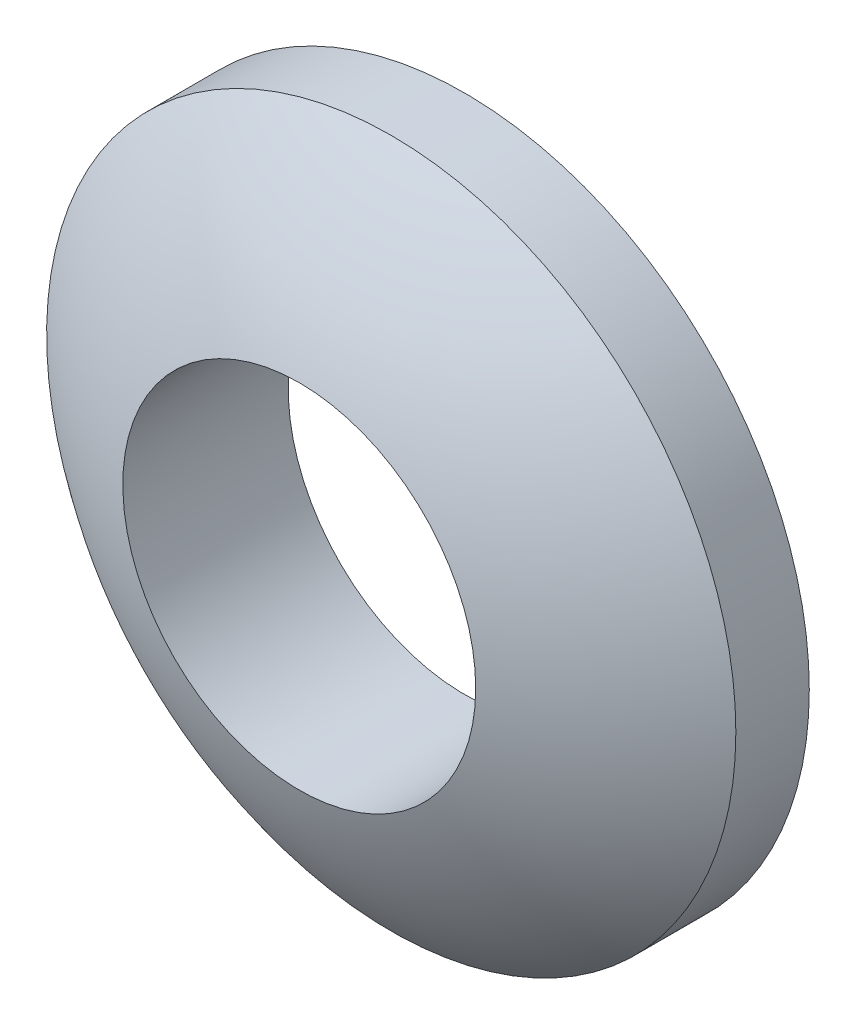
ISO-10303-21;
HEADER;
FILE_DESCRIPTION(('STEP AP214'),'2;1');
FILE_NAME('part.step','',(''),(''),'','','');
FILE_SCHEMA(('AUTOMOTIVE_DESIGN { 1 0 10303 214 1 1 1 1 }'));
ENDSEC;
DATA;
#1=APPLICATION_CONTEXT('core data for automotive mechanical design processes');
#2=APPLICATION_PROTOCOL_DEFINITION('international standard','automotive_design',2000,#1);
#3=PRODUCT_CONTEXT('',#1,'mechanical');
#4=PRODUCT('Part','Part','',(#3));
#5=PRODUCT_RELATED_PRODUCT_CATEGORY('part','',(#4));
#6=PRODUCT_DEFINITION_FORMATION('','',#4);
#7=PRODUCT_DEFINITION_CONTEXT('part definition',#1,'design');
#8=PRODUCT_DEFINITION('design','',#6,#7);
#9=PRODUCT_DEFINITION_SHAPE('','',#8);
#10=(LENGTH_UNIT() NAMED_UNIT(*) SI_UNIT(.MILLI.,.METRE.));
#11=(NAMED_UNIT(*) PLANE_ANGLE_UNIT() SI_UNIT($,.RADIAN.));
#12=(NAMED_UNIT(*) SI_UNIT($,.STERADIAN.) SOLID_ANGLE_UNIT());
#13=UNCERTAINTY_MEASURE_WITH_UNIT(LENGTH_MEASURE(1.E-05),#10,'distance_accuracy_value','');
#14=(GEOMETRIC_REPRESENTATION_CONTEXT(3) GLOBAL_UNCERTAINTY_ASSIGNED_CONTEXT((#13)) GLOBAL_UNIT_ASSIGNED_CONTEXT((#10,
#11,#12)) REPRESENTATION_CONTEXT('',''));
#15=CARTESIAN_POINT('',(0.,0.,0.));
#16=DIRECTION('',(0.,0.,1.));
#17=DIRECTION('',(1.,0.,0.));
#18=AXIS2_PLACEMENT_3D('',#15,#16,#17);
#19=CARTESIAN_POINT('',(0.,0.,58.0500970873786));
#20=DIRECTION('',(0.,0.,1.));
#21=DIRECTION('',(1.,0.,0.));
#22=AXIS2_PLACEMENT_3D('',#19,#20,#21);
#23=CYLINDRICAL_SURFACE('',#22,6.24999999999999);
#24=CARTESIAN_POINT('',(0.,0.,-3.));
#25=DIRECTION('',(0.,0.,1.));
#26=DIRECTION('',(1.,0.,0.));
#27=AXIS2_PLACEMENT_3D('',#24,#25,#26);
#28=CIRCLE('',#27,6.24999999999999);
#29=CARTESIAN_POINT('',(6.24999999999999,0.,-3.));
#30=VERTEX_POINT('',#29);
#31=EDGE_CURVE('E10',#30,#30,#28,.T.);
#32=ORIENTED_EDGE('',*,*,#31,.T.);
#33=EDGE_LOOP('',(#32));
#34=FACE_BOUND('',#33,.T.);
#35=CARTESIAN_POINT('',(0.,0.,-1.66792792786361));
#36=DIRECTION('',(0.,0.,1.));
#37=DIRECTION('',(1.,0.,0.));
#38=AXIS2_PLACEMENT_3D('',#35,#36,#37);
#39=CIRCLE('',#38,6.24999999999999);
#40=CARTESIAN_POINT('',(0.,6.24999999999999,-1.66792792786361));
#41=VERTEX_POINT('',#40);
#42=EDGE_CURVE('E51',#41,#41,#39,.T.);
#43=ORIENTED_EDGE('',*,*,#42,.F.);
#44=EDGE_LOOP('',(#43));
#45=FACE_BOUND('',#44,.T.);
#46=ADVANCED_FACE('F40',(#34,#45),#23,.T.);
#47=CARTESIAN_POINT('',(0.,3.19999999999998,-3.));
#48=DIRECTION('',(0.,0.,-1.));
#49=DIRECTION('',(-1.,0.,0.));
#50=AXIS2_PLACEMENT_3D('',#47,#48,#49);
#51=PLANE('',#50);
#52=CARTESIAN_POINT('',(0.,0.,-3.));
#53=DIRECTION('',(0.,0.,1.));
#54=DIRECTION('',(1.,0.,0.));
#55=AXIS2_PLACEMENT_3D('',#52,#53,#54);
#56=CIRCLE('',#55,3.19999999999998);
#57=CARTESIAN_POINT('',(3.19999999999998,0.,-3.));
#58=VERTEX_POINT('',#57);
#59=EDGE_CURVE('E43',#58,#58,#56,.T.);
#60=ORIENTED_EDGE('',*,*,#59,.T.);
#61=EDGE_LOOP('',(#60));
#62=FACE_BOUND('',#61,.T.);
#63=ORIENTED_EDGE('',*,*,#31,.F.);
#64=EDGE_LOOP('',(#63));
#65=FACE_BOUND('',#64,.T.);
#66=ADVANCED_FACE('F62',(#62,#65),#51,.T.);
#67=CARTESIAN_POINT('',(0.,0.,58.0500970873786));
#68=DIRECTION('',(0.,0.,1.));
#69=DIRECTION('',(1.,0.,0.));
#70=AXIS2_PLACEMENT_3D('',#67,#68,#69);
#71=CYLINDRICAL_SURFACE('',#70,3.19999999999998);
#72=CARTESIAN_POINT('',(0.,0.,0.));
#73=DIRECTION('',(0.,0.,1.));
#74=DIRECTION('',(1.,0.,0.));
#75=AXIS2_PLACEMENT_3D('',#72,#73,#74);
#76=CIRCLE('',#75,3.19999999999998);
#77=CARTESIAN_POINT('',(0.,3.19999999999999,0.));
#78=VERTEX_POINT('',#77);
#79=EDGE_CURVE('E50',#78,#78,#76,.T.);
#80=ORIENTED_EDGE('',*,*,#79,.T.);
#81=EDGE_LOOP('',(#80));
#82=FACE_BOUND('',#81,.T.);
#83=ORIENTED_EDGE('',*,*,#59,.F.);
#84=EDGE_LOOP('',(#83));
#85=FACE_BOUND('',#84,.T.);
#86=ADVANCED_FACE('F63',(#82,#85),#71,.F.);
#87=CARTESIAN_POINT('',(0.,0.,-9.47417542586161));
#88=DIRECTION('',(0.,0.,1.));
#89=DIRECTION('',(0.,1.,0.));
#90=AXIS2_PLACEMENT_3D('',#87,#88,#89);
#91=SPHERICAL_SURFACE('',#90,10.);
#92=CARTESIAN_POINT('',(0.,6.24999999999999,-1.66792792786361));
#93=CARTESIAN_POINT('',(0.,6.22158835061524,-1.64518039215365));
#94=CARTESIAN_POINT('',(0.,6.19305250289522,-1.62258798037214));
#95=CARTESIAN_POINT('',(0.,6.13573583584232,-1.5777160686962));
#96=CARTESIAN_POINT('',(0.,6.10695501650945,-1.55543656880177));
#97=CARTESIAN_POINT('',(0.,6.04915183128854,-1.51119314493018));
#98=CARTESIAN_POINT('',(0.,6.0201294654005,-1.48922922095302));
#99=CARTESIAN_POINT('',(0.,5.96184664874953,-1.4456195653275));
#100=CARTESIAN_POINT('',(0.,5.9325861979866,-1.42397383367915));
#101=CARTESIAN_POINT('',(0.,5.87383069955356,-1.38100314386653));
#102=CARTESIAN_POINT('',(0.,5.84433565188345,-1.35967818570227));
#103=CARTESIAN_POINT('',(0.,5.78511447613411,-1.31735158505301));
#104=CARTESIAN_POINT('',(0.,5.75538834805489,-1.29634994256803));
#105=CARTESIAN_POINT('',(0.,5.69570855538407,-1.25467247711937));
#106=CARTESIAN_POINT('',(0.,5.66575489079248,-1.2339966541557));
#107=CARTESIAN_POINT('',(0.,5.60562359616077,-1.19297329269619));
#108=CARTESIAN_POINT('',(0.,5.57544596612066,-1.17262575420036));
#109=CARTESIAN_POINT('',(0.,5.51487033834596,-1.132261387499));
#110=CARTESIAN_POINT('',(0.,5.48447234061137,-1.11224455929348));
#111=CARTESIAN_POINT('',(0.,5.42345960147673,-1.07254399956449));
#112=CARTESIAN_POINT('',(0.,5.39284486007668,-1.05286026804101));
#113=CARTESIAN_POINT('',(0.,5.3314022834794,-1.01382824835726));
#114=CARTESIAN_POINT('',(0.,5.30057444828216,-0.99447996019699));
#115=CARTESIAN_POINT('',(0.,5.2387093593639,-0.956121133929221));
#116=CARTESIAN_POINT('',(0.,5.20767210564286,-0.937110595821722));
#117=CARTESIAN_POINT('',(0.,5.14539187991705,-0.899429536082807));
#118=CARTESIAN_POINT('',(0.,5.11414890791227,-0.880759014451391));
#119=CARTESIAN_POINT('',(0.,5.05146097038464,-0.843760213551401));
#120=CARTESIAN_POINT('',(0.,5.02001600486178,-0.825431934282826));
#121=CARTESIAN_POINT('',(0.,4.95692782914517,-0.789119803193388));
#122=CARTESIAN_POINT('',(0.,4.92528461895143,-0.771135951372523));
#123=CARTESIAN_POINT('',(0.,4.86180372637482,-0.735514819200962));
#124=CARTESIAN_POINT('',(0.,4.82996604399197,-0.717877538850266));
#125=CARTESIAN_POINT('',(0.,4.76610000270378,-0.682951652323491));
#126=CARTESIAN_POINT('',(0.,4.73407164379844,-0.665663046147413));
#127=CARTESIAN_POINT('',(0.,4.66982806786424,-0.631436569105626));
#128=CARTESIAN_POINT('',(0.,4.63761285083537,-0.614498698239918));
#129=CARTESIAN_POINT('',(0.,4.57299939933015,-0.580975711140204));
#130=CARTESIAN_POINT('',(0.,4.54060116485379,-0.564390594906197));
#131=CARTESIAN_POINT('',(0.,4.47562554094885,-0.531575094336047));
#132=CARTESIAN_POINT('',(0.,4.44304815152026,-0.515344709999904));
#133=CARTESIAN_POINT('',(0.,4.37771810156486,-0.48324060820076));
#134=CARTESIAN_POINT('',(0.,4.34496544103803,-0.467366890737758));
#135=CARTESIAN_POINT('',(0.,4.27928875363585,-0.435978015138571));
#136=CARTESIAN_POINT('',(0.,4.24636472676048,-0.420462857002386));
#137=CARTESIAN_POINT('',(0.,4.18034923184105,-0.389792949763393));
#138=CARTESIAN_POINT('',(0.,4.14725776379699,-0.374638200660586));
#139=CARTESIAN_POINT('',(0.,4.08091133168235,-0.344690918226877));
#140=CARTESIAN_POINT('',(0.,4.04765636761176,-0.329898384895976));
#141=CARTESIAN_POINT('',(0.,3.98098690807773,-0.300677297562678));
#142=CARTESIAN_POINT('',(0.,3.94757241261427,-0.286248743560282));
#143=CARTESIAN_POINT('',(0.,3.88058787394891,-0.257757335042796));
#144=CARTESIAN_POINT('',(0.,3.847017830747,-0.243694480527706));
#145=CARTESIAN_POINT('',(0.,3.77972619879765,-0.215936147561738));
#146=CARTESIAN_POINT('',(0.,3.74600461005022,-0.20224066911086));
#147=CARTESIAN_POINT('',(0.,3.6784139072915,-0.17521872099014));
#148=CARTESIAN_POINT('',(0.,3.64454479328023,-0.161892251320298));
#149=CARTESIAN_POINT('',(0.,3.57666307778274,-0.135609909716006));
#150=CARTESIAN_POINT('',(0.,3.54265047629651,-0.122654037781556));
#151=CARTESIAN_POINT('',(0.,3.47448584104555,-0.0971144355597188));
#152=CARTESIAN_POINT('',(0.,3.44033380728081,-0.0845307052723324));
#153=CARTESIAN_POINT('',(0.,3.37189437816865,-0.0597368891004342));
#154=CARTESIAN_POINT('',(0.,3.33760698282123,-0.0475268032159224));
#155=CARTESIAN_POINT('',(0.,3.26890092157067,-0.0234817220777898));
#156=CARTESIAN_POINT('',(0.,3.23448225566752,-0.011646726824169));
#157=CARTESIAN_POINT('',(0.,3.19999999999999,0.));
#158=B_SPLINE_CURVE_WITH_KNOTS('',3,(#92,#93,#94,#95,#96,#97,#98,#99,#100,#101,#102,#103,#104,
#105,#106,#107,#108,#109,#110,#111,#112,#113,#114,#115,#116,#117,#118,#119,#120,#121,#122,#123,
#124,#125,#126,#127,#128,#129,#130,#131,#132,#133,#134,#135,#136,#137,#138,#139,#140,#141,#142,
#143,#144,#145,#146,#147,#148,#149,#150,#151,#152,#153,#154,#155,#156,#157),.UNSPECIFIED.,.F.,
.F.,(4,2,2,2,2,2,2,2,2,2,2,2,2,2,2,2,2,2,2,2,2,2,2,2,2,2,2,2,2,2,2,2,4),(0.,0.109187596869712,
0.218375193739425,0.327562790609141,0.436750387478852,0.545937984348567,0.655125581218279,
0.764313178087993,0.873500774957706,0.98268837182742,1.09187596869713,1.20106356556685,
1.31025116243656,1.41943875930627,1.52862635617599,1.6378139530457,1.74700154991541,
1.85618914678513,1.96537674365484,2.07456434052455,2.18375193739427,2.29293953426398,
2.40212713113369,2.51131472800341,2.62050232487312,2.72968992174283,2.83887751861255,
2.94806511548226,3.05725271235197,3.16644030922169,3.2756279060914,3.38481550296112,
3.49400309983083),.UNSPECIFIED.);
#159=EDGE_CURVE('BSEAM60',#41,#78,#158,.T.);
#160=ORIENTED_EDGE('',*,*,#42,.T.);
#161=ORIENTED_EDGE('',*,*,#79,.F.);
#162=ORIENTED_EDGE('',*,*,#159,.T.);
#163=ORIENTED_EDGE('',*,*,#159,.F.);
#164=EDGE_LOOP('',(#160,#162,#161,#163));
#165=FACE_BOUND('',#164,.T.);
#166=ADVANCED_FACE('F60',(#165),#91,.T.);
#167=CLOSED_SHELL('',(#46,#66,#86,#166));
#168=MANIFOLD_SOLID_BREP('B2',#167);
#169=ADVANCED_BREP_SHAPE_REPRESENTATION('',(#18,#168),#14);
#170=SHAPE_DEFINITION_REPRESENTATION(#9,#169);
ENDSEC;
END-ISO-10303-21;
